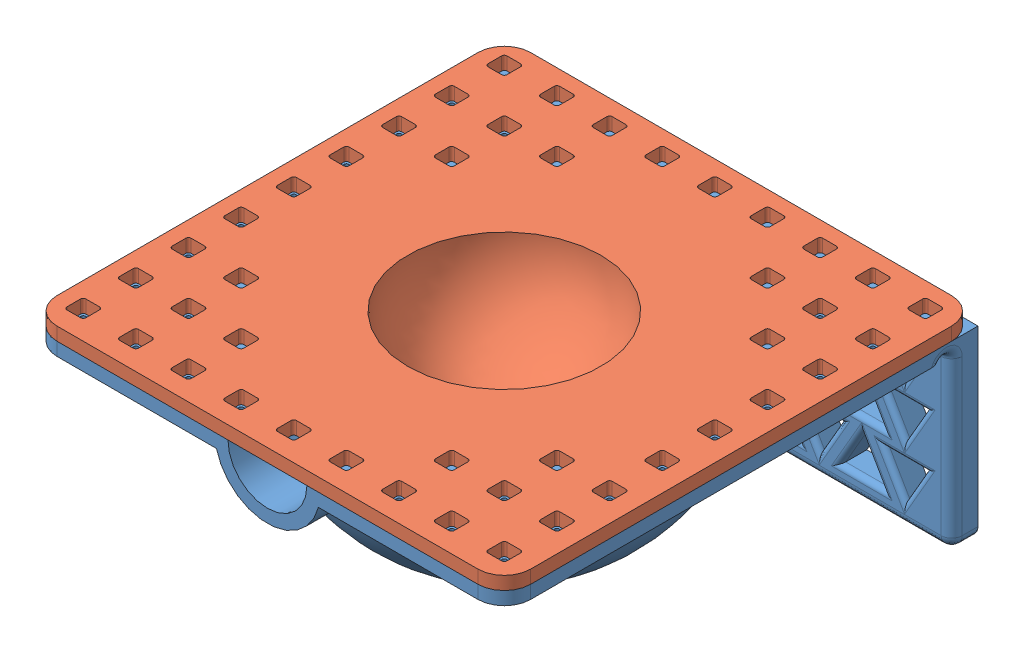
SolidWorks assembly ball mold with fixturing edits.SLDASM, configuration Default (file format 6000). Lengths in mm.
Overall size (114.86 47.62 114.3).
3 component instances, 2 part files, 5 mates.
Components (placement in the parent):
- ball mold outer 3in HoleForFixturing-1: ball mold outer 3in HoleForFixturing.SLDPRT [Default] at origin size (114.86 44.45 114.3)
- ball mold inner 3OD 2p17ID FlatFaceForFixturing-1: ball mold inner 3OD 2p17ID FlatFaceForFixturing.SLDPRT [Default] x (-1 0 0) z (0 0 1) size (114.3 29.63 114.3)
- disk and peg fixture futureversion-1: disk and peg fixture futureversion.SLDASM [Default] at (18.7552 -15.43 -10.9946) x (-0.837169 0 -0.546944) z (-0.546944 0 0.837169) (suppressed, hidden)
Mates (geometry in assembly coordinates):
- Concentric1: concentric: sphere of ball mold outer 3in HoleForFixturing-1; sphere of ball mold inner 3OD 2p17ID FlatFaceForFixturing-1
- Coincident1: coincident aligned: plane of ball mold outer 3in HoleForFixturing-1 through (-57.15 -3.175 57.15) normal (0 0 1); plane of ball mold inner 3OD 2p17ID FlatFaceForFixturing-1 through (57.15 3.175 57.15) normal (0 0 1)
- Coincident2: coincident anti-aligned: plane of ball mold outer 3in HoleForFixturing-1 through (0 0 0) normal (0 1 0); plane of ball mold inner 3OD 2p17ID FlatFaceForFixturing-1 through (0 0 0) normal (0 -1 0)
- Coincident4: coincident anti-aligned: plane of ball mold inner 3OD 2p17ID FlatFaceForFixturing-1 through (0 -26.4583 0) normal (0 -1 0); plane of ? through (0 -26.4583 0) normal (0 1 0)
- Concentric3: concentric aligned: cylinder of ball mold outer 3in HoleForFixturing-1 through (0 -44.45 0) axis (0 1 0) radius 3.175; cylinder of ? through (0 -64.5583 0) axis (0 1 0) radius 3.175
